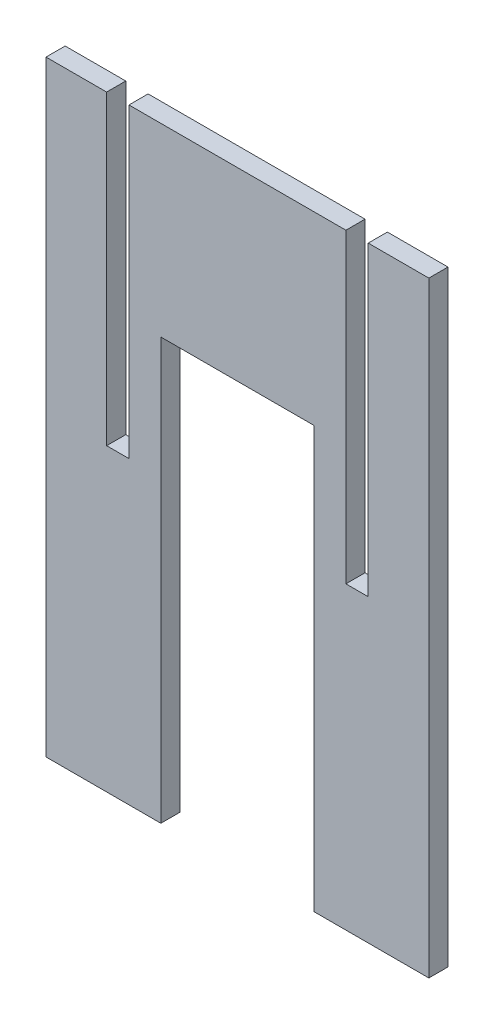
ISO-10303-21;
HEADER;
FILE_DESCRIPTION(('STEP AP214'),'2;1');
FILE_NAME('part.step','',(''),(''),'','','');
FILE_SCHEMA(('AUTOMOTIVE_DESIGN { 1 0 10303 214 1 1 1 1 }'));
ENDSEC;
DATA;
#1=APPLICATION_CONTEXT('core data for automotive mechanical design processes');
#2=APPLICATION_PROTOCOL_DEFINITION('international standard','automotive_design',2000,#1);
#3=PRODUCT_CONTEXT('',#1,'mechanical');
#4=PRODUCT('Part','Part','',(#3));
#5=PRODUCT_RELATED_PRODUCT_CATEGORY('part','',(#4));
#6=PRODUCT_DEFINITION_FORMATION('','',#4);
#7=PRODUCT_DEFINITION_CONTEXT('part definition',#1,'design');
#8=PRODUCT_DEFINITION('design','',#6,#7);
#9=PRODUCT_DEFINITION_SHAPE('','',#8);
#10=(LENGTH_UNIT() NAMED_UNIT(*) SI_UNIT(.MILLI.,.METRE.));
#11=(NAMED_UNIT(*) PLANE_ANGLE_UNIT() SI_UNIT($,.RADIAN.));
#12=(NAMED_UNIT(*) SI_UNIT($,.STERADIAN.) SOLID_ANGLE_UNIT());
#13=UNCERTAINTY_MEASURE_WITH_UNIT(LENGTH_MEASURE(1.E-05),#10,'distance_accuracy_value','');
#14=(GEOMETRIC_REPRESENTATION_CONTEXT(3) GLOBAL_UNCERTAINTY_ASSIGNED_CONTEXT((#13)) GLOBAL_UNIT_ASSIGNED_CONTEXT((#10,
#11,#12)) REPRESENTATION_CONTEXT('',''));
#15=CARTESIAN_POINT('',(0.,0.,0.));
#16=DIRECTION('',(0.,0.,1.));
#17=DIRECTION('',(1.,0.,0.));
#18=AXIS2_PLACEMENT_3D('',#15,#16,#17);
#19=CARTESIAN_POINT('',(0.,95.,3.));
#20=DIRECTION('',(0.,-1.,0.));
#21=DIRECTION('',(0.,0.,-1.));
#22=AXIS2_PLACEMENT_3D('',#19,#20,#21);
#23=PLANE('',#22);
#24=DIRECTION('',(-1.,0.,0.));
#25=VECTOR('',#24,1.);
#26=CARTESIAN_POINT('',(0.,95.,3.));
#27=LINE('',#26,#25);
#28=CARTESIAN_POINT('',(47.,95.,3.));
#29=VERTEX_POINT('',#28);
#30=CARTESIAN_POINT('',(13.,95.,3.));
#31=VERTEX_POINT('',#30);
#32=EDGE_CURVE('E246',#29,#31,#27,.T.);
#33=ORIENTED_EDGE('',*,*,#32,.F.);
#34=DIRECTION('',(0.,0.,1.));
#35=VECTOR('',#34,1.);
#36=CARTESIAN_POINT('',(47.,95.,0.));
#37=LINE('',#36,#35);
#38=CARTESIAN_POINT('',(47.,95.,0.));
#39=VERTEX_POINT('',#38);
#40=EDGE_CURVE('E173',#39,#29,#37,.T.);
#41=ORIENTED_EDGE('',*,*,#40,.F.);
#42=DIRECTION('',(-1.,0.,0.));
#43=VECTOR('',#42,1.);
#44=CARTESIAN_POINT('',(0.,95.,0.));
#45=LINE('',#44,#43);
#46=CARTESIAN_POINT('',(13.,95.,0.));
#47=VERTEX_POINT('',#46);
#48=EDGE_CURVE('E164',#39,#47,#45,.T.);
#49=ORIENTED_EDGE('',*,*,#48,.T.);
#50=DIRECTION('',(0.,0.,1.));
#51=VECTOR('',#50,1.);
#52=CARTESIAN_POINT('',(13.,95.,0.));
#53=LINE('',#52,#51);
#54=EDGE_CURVE('E199',#47,#31,#53,.T.);
#55=ORIENTED_EDGE('',*,*,#54,.T.);
#56=EDGE_LOOP('',(#33,#41,#49,#55));
#57=FACE_BOUND('',#56,.T.);
#58=ADVANCED_FACE('F31',(#57),#23,.F.);
#59=CARTESIAN_POINT('',(9.5,95.,3.));
#60=VERTEX_POINT('',#59);
#61=CARTESIAN_POINT('',(0.,95.,3.));
#62=VERTEX_POINT('',#61);
#63=EDGE_CURVE('E241',#60,#62,#27,.T.);
#64=ORIENTED_EDGE('',*,*,#63,.F.);
#65=DIRECTION('',(0.,0.,1.));
#66=VECTOR('',#65,1.);
#67=CARTESIAN_POINT('',(9.5,95.,0.));
#68=LINE('',#67,#66);
#69=CARTESIAN_POINT('',(9.5,95.,0.));
#70=VERTEX_POINT('',#69);
#71=EDGE_CURVE('E196',#70,#60,#68,.T.);
#72=ORIENTED_EDGE('',*,*,#71,.F.);
#73=CARTESIAN_POINT('',(0.,95.,0.));
#74=VERTEX_POINT('',#73);
#75=EDGE_CURVE('E255',#70,#74,#45,.T.);
#76=ORIENTED_EDGE('',*,*,#75,.T.);
#77=DIRECTION('',(0.,0.,-1.));
#78=VECTOR('',#77,1.);
#79=CARTESIAN_POINT('',(0.,95.,3.));
#80=LINE('',#79,#78);
#81=EDGE_CURVE('E245',#62,#74,#80,.T.);
#82=ORIENTED_EDGE('',*,*,#81,.F.);
#83=EDGE_LOOP('',(#64,#72,#76,#82));
#84=FACE_BOUND('',#83,.T.);
#85=ADVANCED_FACE('F313',(#84),#23,.F.);
#86=CARTESIAN_POINT('',(0.,0.,3.));
#87=DIRECTION('',(0.,1.,0.));
#88=DIRECTION('',(0.,0.,1.));
#89=AXIS2_PLACEMENT_3D('',#86,#87,#88);
#90=PLANE('',#89);
#91=DIRECTION('',(1.,0.,0.));
#92=VECTOR('',#91,1.);
#93=CARTESIAN_POINT('',(0.,0.,0.));
#94=LINE('',#93,#92);
#95=CARTESIAN_POINT('',(0.,0.,0.));
#96=VERTEX_POINT('',#95);
#97=CARTESIAN_POINT('',(18.,0.,0.));
#98=VERTEX_POINT('',#97);
#99=EDGE_CURVE('E250',#96,#98,#94,.T.);
#100=ORIENTED_EDGE('',*,*,#99,.T.);
#101=DIRECTION('',(0.,0.,1.));
#102=VECTOR('',#101,1.);
#103=CARTESIAN_POINT('',(18.,0.,0.));
#104=LINE('',#103,#102);
#105=CARTESIAN_POINT('',(18.,0.,3.));
#106=VERTEX_POINT('',#105);
#107=EDGE_CURVE('E215',#98,#106,#104,.T.);
#108=ORIENTED_EDGE('',*,*,#107,.T.);
#109=DIRECTION('',(1.,0.,0.));
#110=VECTOR('',#109,1.);
#111=CARTESIAN_POINT('',(0.,0.,3.));
#112=LINE('',#111,#110);
#113=CARTESIAN_POINT('',(0.,0.,3.));
#114=VERTEX_POINT('',#113);
#115=EDGE_CURVE('E236',#114,#106,#112,.T.);
#116=ORIENTED_EDGE('',*,*,#115,.F.);
#117=DIRECTION('',(0.,0.,-1.));
#118=VECTOR('',#117,1.);
#119=CARTESIAN_POINT('',(0.,0.,3.));
#120=LINE('',#119,#118);
#121=EDGE_CURVE('E11',#114,#96,#120,.T.);
#122=ORIENTED_EDGE('',*,*,#121,.T.);
#123=EDGE_LOOP('',(#100,#108,#116,#122));
#124=FACE_BOUND('',#123,.T.);
#125=ADVANCED_FACE('F293',(#124),#90,.F.);
#126=CARTESIAN_POINT('',(0.,0.,3.));
#127=DIRECTION('',(1.,0.,0.));
#128=DIRECTION('',(0.,0.,-1.));
#129=AXIS2_PLACEMENT_3D('',#126,#127,#128);
#130=PLANE('',#129);
#131=DIRECTION('',(0.,-1.,0.));
#132=VECTOR('',#131,1.);
#133=CARTESIAN_POINT('',(0.,0.,0.));
#134=LINE('',#133,#132);
#135=EDGE_CURVE('E224',#74,#96,#134,.T.);
#136=ORIENTED_EDGE('',*,*,#135,.T.);
#137=ORIENTED_EDGE('',*,*,#121,.F.);
#138=DIRECTION('',(0.,-1.,0.));
#139=VECTOR('',#138,1.);
#140=CARTESIAN_POINT('',(0.,0.,3.));
#141=LINE('',#140,#139);
#142=EDGE_CURVE('E231',#62,#114,#141,.T.);
#143=ORIENTED_EDGE('',*,*,#142,.F.);
#144=ORIENTED_EDGE('',*,*,#81,.T.);
#145=EDGE_LOOP('',(#136,#137,#143,#144));
#146=FACE_BOUND('',#145,.T.);
#147=ADVANCED_FACE('F33',(#146),#130,.F.);
#148=CARTESIAN_POINT('',(42.,0.,3.));
#149=VERTEX_POINT('',#148);
#150=CARTESIAN_POINT('',(60.,0.,3.));
#151=VERTEX_POINT('',#150);
#152=EDGE_CURVE('E234',#149,#151,#112,.T.);
#153=ORIENTED_EDGE('',*,*,#152,.F.);
#154=DIRECTION('',(0.,0.,1.));
#155=VECTOR('',#154,1.);
#156=CARTESIAN_POINT('',(42.,0.,0.));
#157=LINE('',#156,#155);
#158=CARTESIAN_POINT('',(42.,0.,0.));
#159=VERTEX_POINT('',#158);
#160=EDGE_CURVE('E227',#159,#149,#157,.T.);
#161=ORIENTED_EDGE('',*,*,#160,.F.);
#162=CARTESIAN_POINT('',(60.,0.,0.));
#163=VERTEX_POINT('',#162);
#164=EDGE_CURVE('E249',#159,#163,#94,.T.);
#165=ORIENTED_EDGE('',*,*,#164,.T.);
#166=DIRECTION('',(0.,0.,-1.));
#167=VECTOR('',#166,1.);
#168=CARTESIAN_POINT('',(60.,0.,3.));
#169=LINE('',#168,#167);
#170=EDGE_CURVE('E39',#151,#163,#169,.T.);
#171=ORIENTED_EDGE('',*,*,#170,.F.);
#172=EDGE_LOOP('',(#153,#161,#165,#171));
#173=FACE_BOUND('',#172,.T.);
#174=ADVANCED_FACE('F282',(#173),#90,.F.);
#175=CARTESIAN_POINT('',(60.,0.,3.));
#176=DIRECTION('',(-1.,0.,0.));
#177=DIRECTION('',(0.,0.,1.));
#178=AXIS2_PLACEMENT_3D('',#175,#176,#177);
#179=PLANE('',#178);
#180=DIRECTION('',(0.,1.,0.));
#181=VECTOR('',#180,1.);
#182=CARTESIAN_POINT('',(60.,0.,0.));
#183=LINE('',#182,#181);
#184=CARTESIAN_POINT('',(60.,95.,0.));
#185=VERTEX_POINT('',#184);
#186=EDGE_CURVE('E253',#163,#185,#183,.T.);
#187=ORIENTED_EDGE('',*,*,#186,.T.);
#188=DIRECTION('',(0.,0.,-1.));
#189=VECTOR('',#188,1.);
#190=CARTESIAN_POINT('',(60.,95.,3.));
#191=LINE('',#190,#189);
#192=CARTESIAN_POINT('',(60.,95.,3.));
#193=VERTEX_POINT('',#192);
#194=EDGE_CURVE('E260',#193,#185,#191,.T.);
#195=ORIENTED_EDGE('',*,*,#194,.F.);
#196=DIRECTION('',(0.,1.,0.));
#197=VECTOR('',#196,1.);
#198=CARTESIAN_POINT('',(60.,0.,3.));
#199=LINE('',#198,#197);
#200=EDGE_CURVE('E239',#151,#193,#199,.T.);
#201=ORIENTED_EDGE('',*,*,#200,.F.);
#202=ORIENTED_EDGE('',*,*,#170,.T.);
#203=EDGE_LOOP('',(#187,#195,#201,#202));
#204=FACE_BOUND('',#203,.T.);
#205=ADVANCED_FACE('F267',(#204),#179,.F.);
#206=CARTESIAN_POINT('',(50.5,95.,0.));
#207=VERTEX_POINT('',#206);
#208=EDGE_CURVE('E235',#185,#207,#45,.T.);
#209=ORIENTED_EDGE('',*,*,#208,.T.);
#210=DIRECTION('',(0.,0.,1.));
#211=VECTOR('',#210,1.);
#212=CARTESIAN_POINT('',(50.5,95.,0.));
#213=LINE('',#212,#211);
#214=CARTESIAN_POINT('',(50.5,95.,3.));
#215=VERTEX_POINT('',#214);
#216=EDGE_CURVE('E176',#207,#215,#213,.T.);
#217=ORIENTED_EDGE('',*,*,#216,.T.);
#218=EDGE_CURVE('E242',#193,#215,#27,.T.);
#219=ORIENTED_EDGE('',*,*,#218,.F.);
#220=ORIENTED_EDGE('',*,*,#194,.T.);
#221=EDGE_LOOP('',(#209,#217,#219,#220));
#222=FACE_BOUND('',#221,.T.);
#223=ADVANCED_FACE('F274',(#222),#23,.F.);
#224=CARTESIAN_POINT('',(0.,95.,3.));
#225=DIRECTION('',(0.,0.,-1.));
#226=DIRECTION('',(-1.,0.,0.));
#227=AXIS2_PLACEMENT_3D('',#224,#225,#226);
#228=PLANE('',#227);
#229=DIRECTION('',(1.,0.,0.));
#230=VECTOR('',#229,1.);
#231=CARTESIAN_POINT('',(47.,47.,3.));
#232=LINE('',#231,#230);
#233=CARTESIAN_POINT('',(47.,47.,3.));
#234=VERTEX_POINT('',#233);
#235=CARTESIAN_POINT('',(50.5,47.,3.));
#236=VERTEX_POINT('',#235);
#237=EDGE_CURVE('E167',#234,#236,#232,.T.);
#238=ORIENTED_EDGE('',*,*,#237,.F.);
#239=DIRECTION('',(0.,-1.,0.));
#240=VECTOR('',#239,1.);
#241=CARTESIAN_POINT('',(47.,95.,3.));
#242=LINE('',#241,#240);
#243=EDGE_CURVE('E151',#29,#234,#242,.T.);
#244=ORIENTED_EDGE('',*,*,#243,.F.);
#245=ORIENTED_EDGE('',*,*,#32,.T.);
#246=DIRECTION('',(0.,1.,0.));
#247=VECTOR('',#246,1.);
#248=CARTESIAN_POINT('',(13.,95.,3.));
#249=LINE('',#248,#247);
#250=CARTESIAN_POINT('',(13.,47.,3.));
#251=VERTEX_POINT('',#250);
#252=EDGE_CURVE('E184',#251,#31,#249,.T.);
#253=ORIENTED_EDGE('',*,*,#252,.F.);
#254=DIRECTION('',(1.,0.,0.));
#255=VECTOR('',#254,1.);
#256=CARTESIAN_POINT('',(9.50000000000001,47.,3.));
#257=LINE('',#256,#255);
#258=CARTESIAN_POINT('',(9.50000000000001,47.,3.));
#259=VERTEX_POINT('',#258);
#260=EDGE_CURVE('E191',#259,#251,#257,.T.);
#261=ORIENTED_EDGE('',*,*,#260,.F.);
#262=DIRECTION('',(0.,-1.,0.));
#263=VECTOR('',#262,1.);
#264=CARTESIAN_POINT('',(9.5,95.,3.));
#265=LINE('',#264,#263);
#266=EDGE_CURVE('E175',#60,#259,#265,.T.);
#267=ORIENTED_EDGE('',*,*,#266,.F.);
#268=ORIENTED_EDGE('',*,*,#63,.T.);
#269=ORIENTED_EDGE('',*,*,#142,.T.);
#270=ORIENTED_EDGE('',*,*,#115,.T.);
#271=DIRECTION('',(0.,-1.,0.));
#272=VECTOR('',#271,1.);
#273=CARTESIAN_POINT('',(18.,0.,3.));
#274=LINE('',#273,#272);
#275=CARTESIAN_POINT('',(18.,66.,3.));
#276=VERTEX_POINT('',#275);
#277=EDGE_CURVE('E198',#276,#106,#274,.T.);
#278=ORIENTED_EDGE('',*,*,#277,.F.);
#279=DIRECTION('',(-1.,0.,0.));
#280=VECTOR('',#279,1.);
#281=CARTESIAN_POINT('',(18.,66.,3.));
#282=LINE('',#281,#280);
#283=CARTESIAN_POINT('',(42.,66.,3.));
#284=VERTEX_POINT('',#283);
#285=EDGE_CURVE('E209',#284,#276,#282,.T.);
#286=ORIENTED_EDGE('',*,*,#285,.F.);
#287=DIRECTION('',(0.,1.,0.));
#288=VECTOR('',#287,1.);
#289=CARTESIAN_POINT('',(42.,0.,3.));
#290=LINE('',#289,#288);
#291=EDGE_CURVE('E217',#149,#284,#290,.T.);
#292=ORIENTED_EDGE('',*,*,#291,.F.);
#293=ORIENTED_EDGE('',*,*,#152,.T.);
#294=ORIENTED_EDGE('',*,*,#200,.T.);
#295=ORIENTED_EDGE('',*,*,#218,.T.);
#296=DIRECTION('',(0.,1.,0.));
#297=VECTOR('',#296,1.);
#298=CARTESIAN_POINT('',(50.5,95.,3.));
#299=LINE('',#298,#297);
#300=EDGE_CURVE('E165',#236,#215,#299,.T.);
#301=ORIENTED_EDGE('',*,*,#300,.F.);
#302=EDGE_LOOP('',(#238,#244,#245,#253,#261,#267,#268,#269,#270,#278,#286,#292,#293,#294,#295,#301));
#303=FACE_BOUND('',#302,.T.);
#304=ADVANCED_FACE('F278',(#303),#228,.F.);
#305=CARTESIAN_POINT('',(0.,95.,0.));
#306=DIRECTION('',(0.,0.,-1.));
#307=DIRECTION('',(-1.,0.,0.));
#308=AXIS2_PLACEMENT_3D('',#305,#306,#307);
#309=PLANE('',#308);
#310=DIRECTION('',(0.,-1.,0.));
#311=VECTOR('',#310,1.);
#312=CARTESIAN_POINT('',(47.,95.,0.));
#313=LINE('',#312,#311);
#314=CARTESIAN_POINT('',(47.,47.,0.));
#315=VERTEX_POINT('',#314);
#316=EDGE_CURVE('E148',#39,#315,#313,.T.);
#317=ORIENTED_EDGE('',*,*,#316,.T.);
#318=DIRECTION('',(1.,0.,0.));
#319=VECTOR('',#318,1.);
#320=CARTESIAN_POINT('',(47.,47.,0.));
#321=LINE('',#320,#319);
#322=CARTESIAN_POINT('',(50.5,47.,0.));
#323=VERTEX_POINT('',#322);
#324=EDGE_CURVE('E158',#315,#323,#321,.T.);
#325=ORIENTED_EDGE('',*,*,#324,.T.);
#326=DIRECTION('',(0.,1.,0.));
#327=VECTOR('',#326,1.);
#328=CARTESIAN_POINT('',(50.5,95.,0.));
#329=LINE('',#328,#327);
#330=EDGE_CURVE('E46',#323,#207,#329,.T.);
#331=ORIENTED_EDGE('',*,*,#330,.T.);
#332=ORIENTED_EDGE('',*,*,#208,.F.);
#333=ORIENTED_EDGE('',*,*,#186,.F.);
#334=ORIENTED_EDGE('',*,*,#164,.F.);
#335=DIRECTION('',(0.,1.,0.));
#336=VECTOR('',#335,1.);
#337=CARTESIAN_POINT('',(42.,0.,0.));
#338=LINE('',#337,#336);
#339=CARTESIAN_POINT('',(42.,66.,0.));
#340=VERTEX_POINT('',#339);
#341=EDGE_CURVE('E208',#159,#340,#338,.T.);
#342=ORIENTED_EDGE('',*,*,#341,.T.);
#343=DIRECTION('',(-1.,0.,0.));
#344=VECTOR('',#343,1.);
#345=CARTESIAN_POINT('',(18.,66.,0.));
#346=LINE('',#345,#344);
#347=CARTESIAN_POINT('',(18.,66.,0.));
#348=VERTEX_POINT('',#347);
#349=EDGE_CURVE('E212',#340,#348,#346,.T.);
#350=ORIENTED_EDGE('',*,*,#349,.T.);
#351=DIRECTION('',(0.,-1.,0.));
#352=VECTOR('',#351,1.);
#353=CARTESIAN_POINT('',(18.,0.,0.));
#354=LINE('',#353,#352);
#355=EDGE_CURVE('E205',#348,#98,#354,.T.);
#356=ORIENTED_EDGE('',*,*,#355,.T.);
#357=ORIENTED_EDGE('',*,*,#99,.F.);
#358=ORIENTED_EDGE('',*,*,#135,.F.);
#359=ORIENTED_EDGE('',*,*,#75,.F.);
#360=DIRECTION('',(0.,-1.,0.));
#361=VECTOR('',#360,1.);
#362=CARTESIAN_POINT('',(9.5,95.,0.));
#363=LINE('',#362,#361);
#364=CARTESIAN_POINT('',(9.50000000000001,47.,0.));
#365=VERTEX_POINT('',#364);
#366=EDGE_CURVE('E180',#70,#365,#363,.T.);
#367=ORIENTED_EDGE('',*,*,#366,.T.);
#368=DIRECTION('',(1.,0.,0.));
#369=VECTOR('',#368,1.);
#370=CARTESIAN_POINT('',(9.50000000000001,47.,0.));
#371=LINE('',#370,#369);
#372=CARTESIAN_POINT('',(13.,47.,0.));
#373=VERTEX_POINT('',#372);
#374=EDGE_CURVE('E183',#365,#373,#371,.T.);
#375=ORIENTED_EDGE('',*,*,#374,.T.);
#376=DIRECTION('',(0.,1.,0.));
#377=VECTOR('',#376,1.);
#378=CARTESIAN_POINT('',(13.,95.,0.));
#379=LINE('',#378,#377);
#380=EDGE_CURVE('E54',#373,#47,#379,.T.);
#381=ORIENTED_EDGE('',*,*,#380,.T.);
#382=ORIENTED_EDGE('',*,*,#48,.F.);
#383=EDGE_LOOP('',(#317,#325,#331,#332,#333,#334,#342,#350,#356,#357,#358,#359,#367,#375,#381,#382));
#384=FACE_BOUND('',#383,.T.);
#385=ADVANCED_FACE('F163',(#384),#309,.T.);
#386=CARTESIAN_POINT('',(18.,0.,0.));
#387=DIRECTION('',(-1.,0.,0.));
#388=DIRECTION('',(0.,0.,1.));
#389=AXIS2_PLACEMENT_3D('',#386,#387,#388);
#390=PLANE('',#389);
#391=ORIENTED_EDGE('',*,*,#277,.T.);
#392=ORIENTED_EDGE('',*,*,#107,.F.);
#393=ORIENTED_EDGE('',*,*,#355,.F.);
#394=DIRECTION('',(0.,0.,1.));
#395=VECTOR('',#394,1.);
#396=CARTESIAN_POINT('',(18.,66.,0.));
#397=LINE('',#396,#395);
#398=EDGE_CURVE('E222',#348,#276,#397,.T.);
#399=ORIENTED_EDGE('',*,*,#398,.T.);
#400=EDGE_LOOP('',(#391,#392,#393,#399));
#401=FACE_BOUND('',#400,.T.);
#402=ADVANCED_FACE('F291',(#401),#390,.F.);
#403=CARTESIAN_POINT('',(18.,66.,0.));
#404=DIRECTION('',(0.,1.,0.));
#405=DIRECTION('',(0.,0.,1.));
#406=AXIS2_PLACEMENT_3D('',#403,#404,#405);
#407=PLANE('',#406);
#408=ORIENTED_EDGE('',*,*,#285,.T.);
#409=ORIENTED_EDGE('',*,*,#398,.F.);
#410=ORIENTED_EDGE('',*,*,#349,.F.);
#411=DIRECTION('',(0.,0.,1.));
#412=VECTOR('',#411,1.);
#413=CARTESIAN_POINT('',(42.,66.,0.));
#414=LINE('',#413,#412);
#415=EDGE_CURVE('E225',#340,#284,#414,.T.);
#416=ORIENTED_EDGE('',*,*,#415,.T.);
#417=EDGE_LOOP('',(#408,#409,#410,#416));
#418=FACE_BOUND('',#417,.T.);
#419=ADVANCED_FACE('F288',(#418),#407,.F.);
#420=CARTESIAN_POINT('',(42.,0.,0.));
#421=DIRECTION('',(1.,0.,0.));
#422=DIRECTION('',(0.,0.,-1.));
#423=AXIS2_PLACEMENT_3D('',#420,#421,#422);
#424=PLANE('',#423);
#425=ORIENTED_EDGE('',*,*,#291,.T.);
#426=ORIENTED_EDGE('',*,*,#415,.F.);
#427=ORIENTED_EDGE('',*,*,#341,.F.);
#428=ORIENTED_EDGE('',*,*,#160,.T.);
#429=EDGE_LOOP('',(#425,#426,#427,#428));
#430=FACE_BOUND('',#429,.T.);
#431=ADVANCED_FACE('F284',(#430),#424,.F.);
#432=CARTESIAN_POINT('',(9.5,95.,0.));
#433=DIRECTION('',(-1.,0.,0.));
#434=DIRECTION('',(0.,-1.,0.));
#435=AXIS2_PLACEMENT_3D('',#432,#433,#434);
#436=PLANE('',#435);
#437=ORIENTED_EDGE('',*,*,#266,.T.);
#438=DIRECTION('',(0.,0.,1.));
#439=VECTOR('',#438,1.);
#440=CARTESIAN_POINT('',(9.50000000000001,47.,0.));
#441=LINE('',#440,#439);
#442=EDGE_CURVE('E188',#365,#259,#441,.T.);
#443=ORIENTED_EDGE('',*,*,#442,.F.);
#444=ORIENTED_EDGE('',*,*,#366,.F.);
#445=ORIENTED_EDGE('',*,*,#71,.T.);
#446=EDGE_LOOP('',(#437,#443,#444,#445));
#447=FACE_BOUND('',#446,.T.);
#448=ADVANCED_FACE('F314',(#447),#436,.F.);
#449=CARTESIAN_POINT('',(13.,95.,0.));
#450=DIRECTION('',(1.,0.,0.));
#451=DIRECTION('',(0.,1.,0.));
#452=AXIS2_PLACEMENT_3D('',#449,#450,#451);
#453=PLANE('',#452);
#454=ORIENTED_EDGE('',*,*,#252,.T.);
#455=ORIENTED_EDGE('',*,*,#54,.F.);
#456=ORIENTED_EDGE('',*,*,#380,.F.);
#457=DIRECTION('',(0.,0.,1.));
#458=VECTOR('',#457,1.);
#459=CARTESIAN_POINT('',(13.,47.,0.));
#460=LINE('',#459,#458);
#461=EDGE_CURVE('E202',#373,#251,#460,.T.);
#462=ORIENTED_EDGE('',*,*,#461,.T.);
#463=EDGE_LOOP('',(#454,#455,#456,#462));
#464=FACE_BOUND('',#463,.T.);
#465=ADVANCED_FACE('F306',(#464),#453,.F.);
#466=CARTESIAN_POINT('',(9.50000000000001,47.,0.));
#467=DIRECTION('',(0.,-1.,0.));
#468=DIRECTION('',(0.,0.,-1.));
#469=AXIS2_PLACEMENT_3D('',#466,#467,#468);
#470=PLANE('',#469);
#471=ORIENTED_EDGE('',*,*,#260,.T.);
#472=ORIENTED_EDGE('',*,*,#461,.F.);
#473=ORIENTED_EDGE('',*,*,#374,.F.);
#474=ORIENTED_EDGE('',*,*,#442,.T.);
#475=EDGE_LOOP('',(#471,#472,#473,#474));
#476=FACE_BOUND('',#475,.T.);
#477=ADVANCED_FACE('F310',(#476),#470,.F.);
#478=CARTESIAN_POINT('',(47.,95.,0.));
#479=DIRECTION('',(-1.,0.,0.));
#480=DIRECTION('',(0.,-1.,0.));
#481=AXIS2_PLACEMENT_3D('',#478,#479,#480);
#482=PLANE('',#481);
#483=ORIENTED_EDGE('',*,*,#243,.T.);
#484=DIRECTION('',(0.,0.,1.));
#485=VECTOR('',#484,1.);
#486=CARTESIAN_POINT('',(47.,47.,0.));
#487=LINE('',#486,#485);
#488=EDGE_CURVE('E144',#315,#234,#487,.T.);
#489=ORIENTED_EDGE('',*,*,#488,.F.);
#490=ORIENTED_EDGE('',*,*,#316,.F.);
#491=ORIENTED_EDGE('',*,*,#40,.T.);
#492=EDGE_LOOP('',(#483,#489,#490,#491));
#493=FACE_BOUND('',#492,.T.);
#494=ADVANCED_FACE('F146',(#493),#482,.F.);
#495=CARTESIAN_POINT('',(50.5,95.,0.));
#496=DIRECTION('',(1.,0.,0.));
#497=DIRECTION('',(0.,1.,0.));
#498=AXIS2_PLACEMENT_3D('',#495,#496,#497);
#499=PLANE('',#498);
#500=ORIENTED_EDGE('',*,*,#300,.T.);
#501=ORIENTED_EDGE('',*,*,#216,.F.);
#502=ORIENTED_EDGE('',*,*,#330,.F.);
#503=DIRECTION('',(0.,0.,1.));
#504=VECTOR('',#503,1.);
#505=CARTESIAN_POINT('',(50.5,47.,0.));
#506=LINE('',#505,#504);
#507=EDGE_CURVE('E155',#323,#236,#506,.T.);
#508=ORIENTED_EDGE('',*,*,#507,.T.);
#509=EDGE_LOOP('',(#500,#501,#502,#508));
#510=FACE_BOUND('',#509,.T.);
#511=ADVANCED_FACE('F428',(#510),#499,.F.);
#512=CARTESIAN_POINT('',(47.,47.,0.));
#513=DIRECTION('',(0.,-1.,0.));
#514=DIRECTION('',(0.,0.,-1.));
#515=AXIS2_PLACEMENT_3D('',#512,#513,#514);
#516=PLANE('',#515);
#517=ORIENTED_EDGE('',*,*,#237,.T.);
#518=ORIENTED_EDGE('',*,*,#507,.F.);
#519=ORIENTED_EDGE('',*,*,#324,.F.);
#520=ORIENTED_EDGE('',*,*,#488,.T.);
#521=EDGE_LOOP('',(#517,#518,#519,#520));
#522=FACE_BOUND('',#521,.T.);
#523=ADVANCED_FACE('F159',(#522),#516,.F.);
#524=CLOSED_SHELL('',(#58,#85,#125,#147,#174,#205,#223,#304,#385,#402,#419,#431,#448,#465,#477,
#494,#511,#523));
#525=MANIFOLD_SOLID_BREP('B2',#524);
#526=ADVANCED_BREP_SHAPE_REPRESENTATION('',(#18,#525),#14);
#527=SHAPE_DEFINITION_REPRESENTATION(#9,#526);
ENDSEC;
END-ISO-10303-21;
